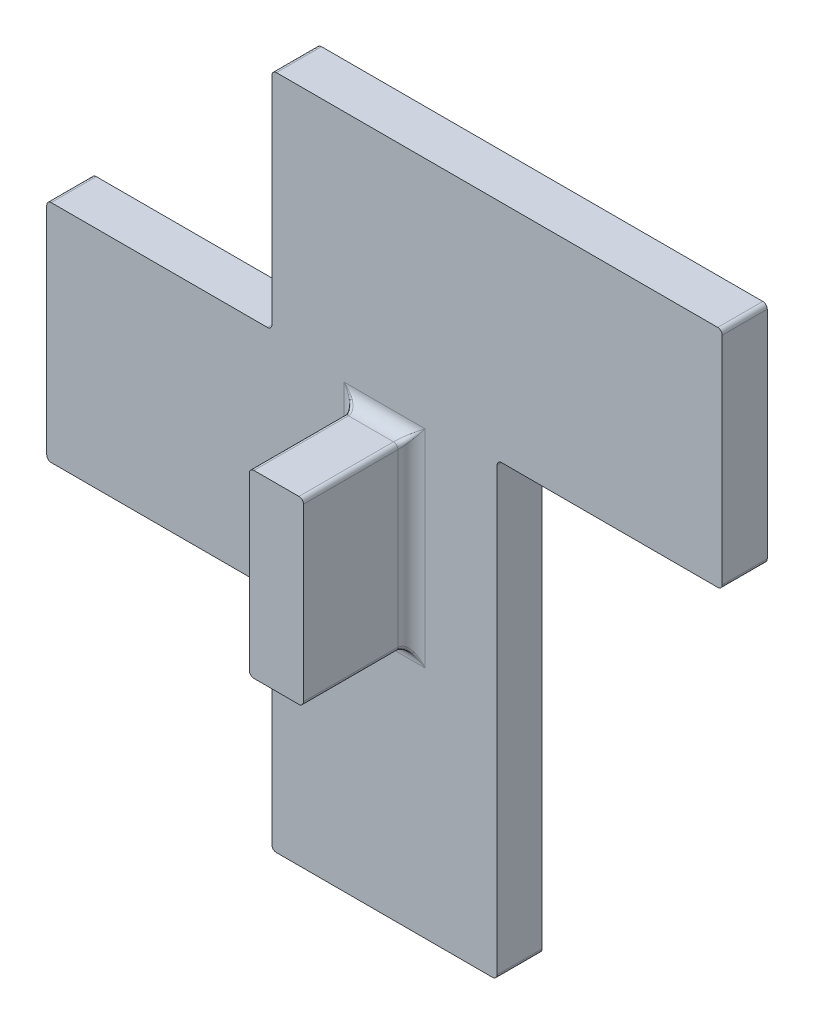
from build123d import *

# Parameters (mm, degrees)
AUFSATZ_LINEAR_AUSTRAGEN1_DEPTH = 5
VERRUNDUNG1_R                   = 0.5
SKIZZE2_W                       = 6
SKIZZE2_H                       = 20
AUFSATZ_LINEAR_AUSTRAGEN2_DEPTH = 12
VERRUNDUNG2_R                   = 1.5
VERRUNDUNG3_R                   = 0.5


with BuildPart() as part:
    # Skizze1 → Aufsatz-Linear austragen1 (new body)
    with BuildSketch(Plane.XY):
        Polygon((0, 0), (0, 25), (-25, 25), (-25, 50), (0, 50), (0, 75), (50, 75), (50, 50), (25, 50), (25, 0), align=None)
    extrude(amount=AUFSATZ_LINEAR_AUSTRAGEN1_DEPTH)

    # Verrundung1
    verrundung1_edges = [part.edges().sort_by_distance(p)[0] for p in [
        (0, 0, 2.5),
        (0, 25, 2.5),
        (-25, 25, 2.5),
        (-25, 50, 2.5),
        (0, 50, 2.5),
        (0, 75, 2.5),
        (50, 75, 2.5),
        (50, 50, 2.5),
        (25, 50, 2.5),
        (25, 0, 2.5),
    ]]
    fillet(verrundung1_edges, radius=VERRUNDUNG1_R)

    # Skizze2 → Aufsatz-Linear austragen2 (add)
    with BuildSketch(Plane.XY.offset(5)):
        with Locations((12.5, 37.5)):
            Rectangle(SKIZZE2_W, SKIZZE2_H)
    extrude(amount=AUFSATZ_LINEAR_AUSTRAGEN2_DEPTH)

    # Verrundung2
    verrundung2_edges = [part.edges().sort_by_distance(p)[0] for p in [
        (9.5, 37.5, 5),
        (12.5, 27.5, 5),
        (15.5, 37.5, 5),
        (12.5, 47.5, 5),
    ]]
    fillet(verrundung2_edges, radius=VERRUNDUNG2_R)

    # Verrundung3
    verrundung3_edges = [part.edges().sort_by_distance(p)[0] for p in [
        (9.5, 47.5, 11.75),
        (9.5, 27.5, 11.75),
        (15.5, 27.5, 11.75),
        (15.5, 47.5, 11.75),
        (16.030926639, 26.969073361, 5.355055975),
        (8.969073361, 26.969073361, 5.355055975),
        (16.030926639, 48.030926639, 5.355055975),
        (8.969073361, 48.030926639, 5.355055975),
    ]]
    fillet(verrundung3_edges, radius=VERRUNDUNG3_R)


solid = part.part
